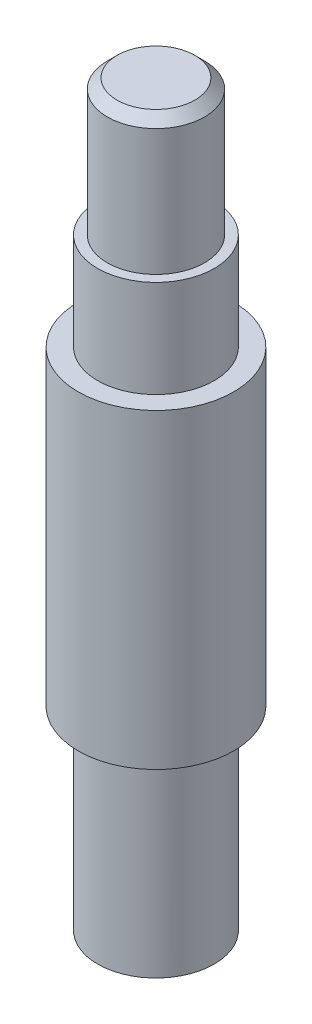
ISO-10303-21;
HEADER;
FILE_DESCRIPTION(('STEP AP214'),'2;1');
FILE_NAME('part.step','',(''),(''),'','','');
FILE_SCHEMA(('AUTOMOTIVE_DESIGN { 1 0 10303 214 1 1 1 1 }'));
ENDSEC;
DATA;
#1=APPLICATION_CONTEXT('core data for automotive mechanical design processes');
#2=APPLICATION_PROTOCOL_DEFINITION('international standard','automotive_design',2000,#1);
#3=PRODUCT_CONTEXT('',#1,'mechanical');
#4=PRODUCT('Part','Part','',(#3));
#5=PRODUCT_RELATED_PRODUCT_CATEGORY('part','',(#4));
#6=PRODUCT_DEFINITION_FORMATION('','',#4);
#7=PRODUCT_DEFINITION_CONTEXT('part definition',#1,'design');
#8=PRODUCT_DEFINITION('design','',#6,#7);
#9=PRODUCT_DEFINITION_SHAPE('','',#8);
#10=(LENGTH_UNIT() NAMED_UNIT(*) SI_UNIT(.MILLI.,.METRE.));
#11=(NAMED_UNIT(*) PLANE_ANGLE_UNIT() SI_UNIT($,.RADIAN.));
#12=(NAMED_UNIT(*) SI_UNIT($,.STERADIAN.) SOLID_ANGLE_UNIT());
#13=UNCERTAINTY_MEASURE_WITH_UNIT(LENGTH_MEASURE(1.E-05),#10,'distance_accuracy_value','');
#14=(GEOMETRIC_REPRESENTATION_CONTEXT(3) GLOBAL_UNCERTAINTY_ASSIGNED_CONTEXT((#13)) GLOBAL_UNIT_ASSIGNED_CONTEXT((#10,
#11,#12)) REPRESENTATION_CONTEXT('',''));
#15=CARTESIAN_POINT('',(0.,0.,0.));
#16=DIRECTION('',(0.,0.,1.));
#17=DIRECTION('',(1.,0.,0.));
#18=AXIS2_PLACEMENT_3D('',#15,#16,#17);
#19=CARTESIAN_POINT('',(0.,21.,0.));
#20=DIRECTION('',(0.,1.,0.));
#21=DIRECTION('',(0.,0.,1.));
#22=AXIS2_PLACEMENT_3D('',#19,#20,#21);
#23=PLANE('',#22);
#24=CARTESIAN_POINT('',(0.,21.,0.));
#25=DIRECTION('',(0.,1.,0.));
#26=DIRECTION('',(0.,0.,1.));
#27=AXIS2_PLACEMENT_3D('',#24,#25,#26);
#28=CIRCLE('',#27,3.);
#29=CARTESIAN_POINT('',(0.,21.,3.));
#30=VERTEX_POINT('',#29);
#31=EDGE_CURVE('E57',#30,#30,#28,.T.);
#32=ORIENTED_EDGE('',*,*,#31,.T.);
#33=EDGE_LOOP('',(#32));
#34=FACE_BOUND('',#33,.T.);
#35=CARTESIAN_POINT('',(0.,21.,0.));
#36=DIRECTION('',(0.,1.,0.));
#37=DIRECTION('',(0.,0.,1.));
#38=AXIS2_PLACEMENT_3D('',#35,#36,#37);
#39=CIRCLE('',#38,2.5);
#40=CARTESIAN_POINT('',(0.,21.,2.5));
#41=VERTEX_POINT('',#40);
#42=EDGE_CURVE('E61',#41,#41,#39,.T.);
#43=ORIENTED_EDGE('',*,*,#42,.F.);
#44=EDGE_LOOP('',(#43));
#45=FACE_BOUND('',#44,.T.);
#46=ADVANCED_FACE('F31',(#34,#45),#23,.T.);
#47=CARTESIAN_POINT('',(0.,16.,0.));
#48=DIRECTION('',(0.,1.,0.));
#49=DIRECTION('',(0.,0.,1.));
#50=AXIS2_PLACEMENT_3D('',#47,#48,#49);
#51=PLANE('',#50);
#52=CARTESIAN_POINT('',(0.,16.,0.));
#53=DIRECTION('',(0.,1.,0.));
#54=DIRECTION('',(0.,0.,1.));
#55=AXIS2_PLACEMENT_3D('',#52,#53,#54);
#56=CIRCLE('',#55,4.);
#57=CARTESIAN_POINT('',(0.,16.,4.));
#58=VERTEX_POINT('',#57);
#59=EDGE_CURVE('E46',#58,#58,#56,.T.);
#60=ORIENTED_EDGE('',*,*,#59,.T.);
#61=EDGE_LOOP('',(#60));
#62=FACE_BOUND('',#61,.T.);
#63=CARTESIAN_POINT('',(0.,16.,0.));
#64=DIRECTION('',(0.,1.,0.));
#65=DIRECTION('',(0.,0.,1.));
#66=AXIS2_PLACEMENT_3D('',#63,#64,#65);
#67=CIRCLE('',#66,3.);
#68=CARTESIAN_POINT('',(0.,16.,3.));
#69=VERTEX_POINT('',#68);
#70=EDGE_CURVE('E58',#69,#69,#67,.T.);
#71=ORIENTED_EDGE('',*,*,#70,.F.);
#72=EDGE_LOOP('',(#71));
#73=FACE_BOUND('',#72,.T.);
#74=ADVANCED_FACE('F70',(#62,#73),#51,.T.);
#75=CARTESIAN_POINT('',(0.,0.,0.));
#76=DIRECTION('',(0.,1.,0.));
#77=DIRECTION('',(0.,0.,1.));
#78=AXIS2_PLACEMENT_3D('',#75,#76,#77);
#79=PLANE('',#78);
#80=CARTESIAN_POINT('',(0.,0.,0.));
#81=DIRECTION('',(0.,1.,0.));
#82=DIRECTION('',(0.,0.,1.));
#83=AXIS2_PLACEMENT_3D('',#80,#81,#82);
#84=CIRCLE('',#83,4.);
#85=CARTESIAN_POINT('',(0.,0.,4.));
#86=VERTEX_POINT('',#85);
#87=EDGE_CURVE('E49',#86,#86,#84,.T.);
#88=ORIENTED_EDGE('',*,*,#87,.F.);
#89=EDGE_LOOP('',(#88));
#90=FACE_BOUND('',#89,.T.);
#91=CARTESIAN_POINT('',(0.,0.,0.));
#92=DIRECTION('',(0.,1.,0.));
#93=DIRECTION('',(0.,0.,1.));
#94=AXIS2_PLACEMENT_3D('',#91,#92,#93);
#95=CIRCLE('',#94,3.);
#96=CARTESIAN_POINT('',(0.,0.,3.));
#97=VERTEX_POINT('',#96);
#98=EDGE_CURVE('E42',#97,#97,#95,.F.);
#99=ORIENTED_EDGE('',*,*,#98,.F.);
#100=EDGE_LOOP('',(#99));
#101=FACE_BOUND('',#100,.T.);
#102=ADVANCED_FACE('F76',(#90,#101),#79,.F.);
#103=CARTESIAN_POINT('',(0.,16.,0.));
#104=DIRECTION('',(0.,-1.,0.));
#105=DIRECTION('',(0.,0.,-1.));
#106=AXIS2_PLACEMENT_3D('',#103,#104,#105);
#107=CYLINDRICAL_SURFACE('',#106,4.);
#108=ORIENTED_EDGE('',*,*,#59,.F.);
#109=EDGE_LOOP('',(#108));
#110=FACE_BOUND('',#109,.T.);
#111=ORIENTED_EDGE('',*,*,#87,.T.);
#112=EDGE_LOOP('',(#111));
#113=FACE_BOUND('',#112,.T.);
#114=ADVANCED_FACE('F92',(#110,#113),#107,.T.);
#115=CARTESIAN_POINT('',(0.,-10.,0.));
#116=DIRECTION('',(0.,1.,0.));
#117=DIRECTION('',(0.,0.,1.));
#118=AXIS2_PLACEMENT_3D('',#115,#116,#117);
#119=CYLINDRICAL_SURFACE('',#118,3.);
#120=CARTESIAN_POINT('',(0.,-10.,0.));
#121=DIRECTION('',(0.,-1.,0.));
#122=DIRECTION('',(0.,0.,-1.));
#123=AXIS2_PLACEMENT_3D('',#120,#121,#122);
#124=CIRCLE('',#123,3.);
#125=CARTESIAN_POINT('',(0.,-10.,-3.));
#126=VERTEX_POINT('',#125);
#127=EDGE_CURVE('E52',#126,#126,#124,.T.);
#128=ORIENTED_EDGE('',*,*,#127,.F.);
#129=EDGE_LOOP('',(#128));
#130=FACE_BOUND('',#129,.T.);
#131=ORIENTED_EDGE('',*,*,#98,.T.);
#132=EDGE_LOOP('',(#131));
#133=FACE_BOUND('',#132,.T.);
#134=ADVANCED_FACE('F89',(#130,#133),#119,.T.);
#135=CARTESIAN_POINT('',(0.,-10.,0.));
#136=DIRECTION('',(0.,-1.,0.));
#137=DIRECTION('',(0.,0.,-1.));
#138=AXIS2_PLACEMENT_3D('',#135,#136,#137);
#139=PLANE('',#138);
#140=ORIENTED_EDGE('',*,*,#127,.T.);
#141=EDGE_LOOP('',(#140));
#142=FACE_BOUND('',#141,.T.);
#143=ADVANCED_FACE('F85',(#142),#139,.T.);
#144=CARTESIAN_POINT('',(0.,21.,0.));
#145=DIRECTION('',(0.,-1.,0.));
#146=DIRECTION('',(0.,0.,-1.));
#147=AXIS2_PLACEMENT_3D('',#144,#145,#146);
#148=CYLINDRICAL_SURFACE('',#147,3.);
#149=ORIENTED_EDGE('',*,*,#31,.F.);
#150=EDGE_LOOP('',(#149));
#151=FACE_BOUND('',#150,.T.);
#152=ORIENTED_EDGE('',*,*,#70,.T.);
#153=EDGE_LOOP('',(#152));
#154=FACE_BOUND('',#153,.T.);
#155=ADVANCED_FACE('F82',(#151,#154),#148,.T.);
#156=CARTESIAN_POINT('',(0.,28.,0.));
#157=DIRECTION('',(0.,-1.,0.));
#158=DIRECTION('',(0.,0.,-1.));
#159=AXIS2_PLACEMENT_3D('',#156,#157,#158);
#160=CYLINDRICAL_SURFACE('',#159,2.5);
#161=CARTESIAN_POINT('',(0.,27.5,0.));
#162=DIRECTION('',(0.,1.,0.));
#163=DIRECTION('',(0.,0.,1.));
#164=AXIS2_PLACEMENT_3D('',#161,#162,#163);
#165=CIRCLE('',#164,2.5);
#166=CARTESIAN_POINT('',(0.,27.5,2.5));
#167=VERTEX_POINT('',#166);
#168=EDGE_CURVE('E10',#167,#167,#165,.F.);
#169=ORIENTED_EDGE('',*,*,#168,.T.);
#170=EDGE_LOOP('',(#169));
#171=FACE_BOUND('',#170,.T.);
#172=ORIENTED_EDGE('',*,*,#42,.T.);
#173=EDGE_LOOP('',(#172));
#174=FACE_BOUND('',#173,.T.);
#175=ADVANCED_FACE('F67',(#171,#174),#160,.T.);
#176=CARTESIAN_POINT('',(0.,28.,0.));
#177=DIRECTION('',(0.,1.,0.));
#178=DIRECTION('',(0.,0.,1.));
#179=AXIS2_PLACEMENT_3D('',#176,#177,#178);
#180=PLANE('',#179);
#181=CARTESIAN_POINT('',(0.,28.,0.));
#182=DIRECTION('',(0.,1.,0.));
#183=DIRECTION('',(0.,0.,1.));
#184=AXIS2_PLACEMENT_3D('',#181,#182,#183);
#185=CIRCLE('',#184,2.00000000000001);
#186=CARTESIAN_POINT('',(0.,28.,2.00000000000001));
#187=VERTEX_POINT('',#186);
#188=EDGE_CURVE('E38',#187,#187,#185,.T.);
#189=ORIENTED_EDGE('',*,*,#188,.T.);
#190=EDGE_LOOP('',(#189));
#191=FACE_BOUND('',#190,.T.);
#192=ADVANCED_FACE('F131',(#191),#180,.T.);
#193=CARTESIAN_POINT('',(0.,28.,0.));
#194=DIRECTION('',(0.,-1.,0.));
#195=DIRECTION('',(0.,0.,-1.));
#196=AXIS2_PLACEMENT_3D('',#193,#194,#195);
#197=CONICAL_SURFACE('',#196,2.00000000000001,0.785398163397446);
#198=ORIENTED_EDGE('',*,*,#168,.F.);
#199=EDGE_LOOP('',(#198));
#200=FACE_BOUND('',#199,.T.);
#201=ORIENTED_EDGE('',*,*,#188,.F.);
#202=EDGE_LOOP('',(#201));
#203=FACE_BOUND('',#202,.T.);
#204=ADVANCED_FACE('F33',(#200,#203),#197,.T.);
#205=CLOSED_SHELL('',(#46,#74,#102,#114,#134,#143,#155,#175,#192,#204));
#206=MANIFOLD_SOLID_BREP('B2',#205);
#207=ADVANCED_BREP_SHAPE_REPRESENTATION('',(#18,#206),#14);
#208=SHAPE_DEFINITION_REPRESENTATION(#9,#207);
ENDSEC;
END-ISO-10303-21;
